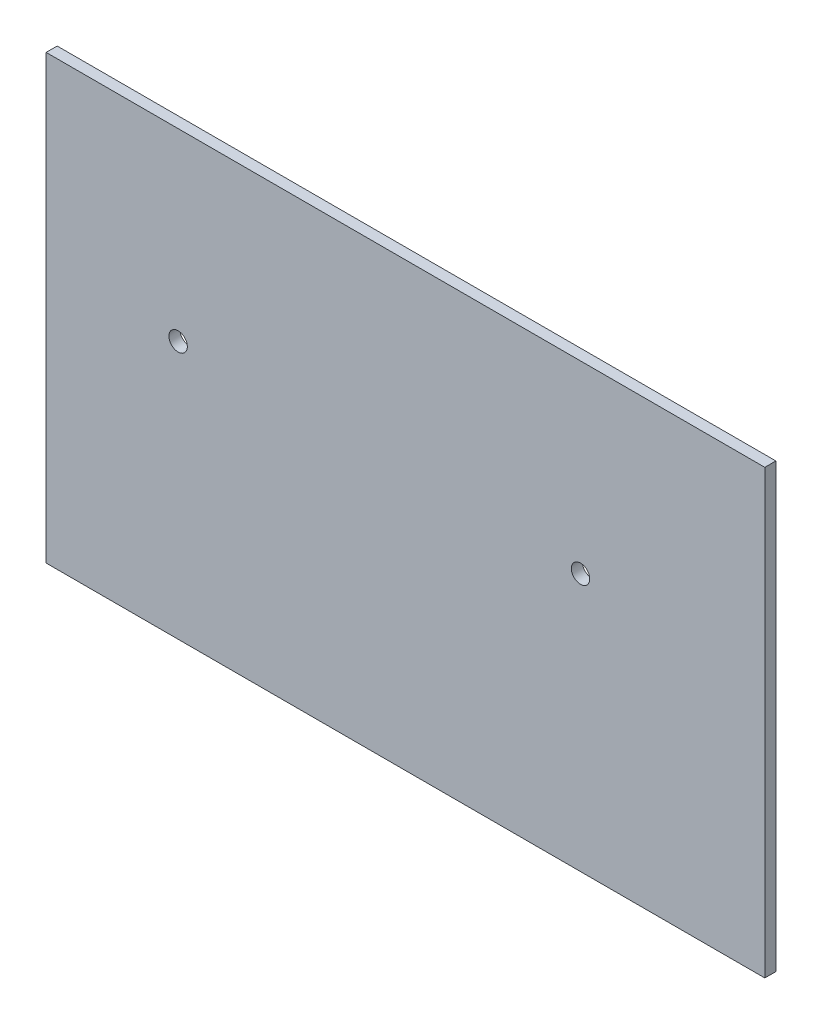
ISO-10303-21;
HEADER;
FILE_DESCRIPTION(('STEP AP214'),'2;1');
FILE_NAME('part.step','',(''),(''),'','','');
FILE_SCHEMA(('AUTOMOTIVE_DESIGN { 1 0 10303 214 1 1 1 1 }'));
ENDSEC;
DATA;
#1=APPLICATION_CONTEXT('core data for automotive mechanical design processes');
#2=APPLICATION_PROTOCOL_DEFINITION('international standard','automotive_design',2000,#1);
#3=PRODUCT_CONTEXT('',#1,'mechanical');
#4=PRODUCT('Part','Part','',(#3));
#5=PRODUCT_RELATED_PRODUCT_CATEGORY('part','',(#4));
#6=PRODUCT_DEFINITION_FORMATION('','',#4);
#7=PRODUCT_DEFINITION_CONTEXT('part definition',#1,'design');
#8=PRODUCT_DEFINITION('design','',#6,#7);
#9=PRODUCT_DEFINITION_SHAPE('','',#8);
#10=(LENGTH_UNIT() NAMED_UNIT(*) SI_UNIT(.MILLI.,.METRE.));
#11=(NAMED_UNIT(*) PLANE_ANGLE_UNIT() SI_UNIT($,.RADIAN.));
#12=(NAMED_UNIT(*) SI_UNIT($,.STERADIAN.) SOLID_ANGLE_UNIT());
#13=UNCERTAINTY_MEASURE_WITH_UNIT(LENGTH_MEASURE(1.E-05),#10,'distance_accuracy_value','');
#14=(GEOMETRIC_REPRESENTATION_CONTEXT(3) GLOBAL_UNCERTAINTY_ASSIGNED_CONTEXT((#13)) GLOBAL_UNIT_ASSIGNED_CONTEXT((#10,
#11,#12)) REPRESENTATION_CONTEXT('',''));
#15=CARTESIAN_POINT('',(0.,0.,0.));
#16=DIRECTION('',(0.,0.,1.));
#17=DIRECTION('',(1.,0.,0.));
#18=AXIS2_PLACEMENT_3D('',#15,#16,#17);
#19=CARTESIAN_POINT('',(-75.7745027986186,50.7636179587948,3.));
#20=DIRECTION('',(1.,0.,0.));
#21=DIRECTION('',(0.,1.,0.));
#22=AXIS2_PLACEMENT_3D('',#19,#20,#21);
#23=PLANE('',#22);
#24=DIRECTION('',(0.,-1.,0.));
#25=VECTOR('',#24,1.);
#26=CARTESIAN_POINT('',(-75.7745027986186,50.7636179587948,0.));
#27=LINE('',#26,#25);
#28=CARTESIAN_POINT('',(-75.7745027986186,50.7636179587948,0.));
#29=VERTEX_POINT('',#28);
#30=CARTESIAN_POINT('',(-75.7745027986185,-69.2363820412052,0.));
#31=VERTEX_POINT('',#30);
#32=EDGE_CURVE('E79',#29,#31,#27,.T.);
#33=ORIENTED_EDGE('',*,*,#32,.T.);
#34=DIRECTION('',(0.,0.,-1.));
#35=VECTOR('',#34,1.);
#36=CARTESIAN_POINT('',(-75.7745027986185,-69.2363820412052,3.));
#37=LINE('',#36,#35);
#38=CARTESIAN_POINT('',(-75.7745027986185,-69.2363820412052,3.));
#39=VERTEX_POINT('',#38);
#40=EDGE_CURVE('E11',#39,#31,#37,.T.);
#41=ORIENTED_EDGE('',*,*,#40,.F.);
#42=DIRECTION('',(0.,-1.,0.));
#43=VECTOR('',#42,1.);
#44=CARTESIAN_POINT('',(-75.7745027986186,50.7636179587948,3.));
#45=LINE('',#44,#43);
#46=CARTESIAN_POINT('',(-75.7745027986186,50.7636179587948,3.));
#47=VERTEX_POINT('',#46);
#48=EDGE_CURVE('E103',#47,#39,#45,.T.);
#49=ORIENTED_EDGE('',*,*,#48,.F.);
#50=DIRECTION('',(0.,0.,-1.));
#51=VECTOR('',#50,1.);
#52=CARTESIAN_POINT('',(-75.7745027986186,50.7636179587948,3.));
#53=LINE('',#52,#51);
#54=EDGE_CURVE('E91',#47,#29,#53,.T.);
#55=ORIENTED_EDGE('',*,*,#54,.T.);
#56=EDGE_LOOP('',(#33,#41,#49,#55));
#57=FACE_BOUND('',#56,.T.);
#58=ADVANCED_FACE('F35',(#57),#23,.F.);
#59=CARTESIAN_POINT('',(-75.7745027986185,-69.2363820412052,3.));
#60=DIRECTION('',(0.,1.,0.));
#61=DIRECTION('',(0.,0.,1.));
#62=AXIS2_PLACEMENT_3D('',#59,#60,#61);
#63=PLANE('',#62);
#64=DIRECTION('',(1.,0.,0.));
#65=VECTOR('',#64,1.);
#66=CARTESIAN_POINT('',(-75.7745027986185,-69.2363820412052,0.));
#67=LINE('',#66,#65);
#68=CARTESIAN_POINT('',(119.225497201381,-69.2363820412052,0.));
#69=VERTEX_POINT('',#68);
#70=EDGE_CURVE('E75',#31,#69,#67,.T.);
#71=ORIENTED_EDGE('',*,*,#70,.T.);
#72=DIRECTION('',(0.,0.,-1.));
#73=VECTOR('',#72,1.);
#74=CARTESIAN_POINT('',(119.225497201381,-69.2363820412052,3.));
#75=LINE('',#74,#73);
#76=CARTESIAN_POINT('',(119.225497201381,-69.2363820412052,3.));
#77=VERTEX_POINT('',#76);
#78=EDGE_CURVE('E42',#77,#69,#75,.T.);
#79=ORIENTED_EDGE('',*,*,#78,.F.);
#80=DIRECTION('',(1.,0.,0.));
#81=VECTOR('',#80,1.);
#82=CARTESIAN_POINT('',(-75.7745027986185,-69.2363820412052,3.));
#83=LINE('',#82,#81);
#84=EDGE_CURVE('E87',#39,#77,#83,.T.);
#85=ORIENTED_EDGE('',*,*,#84,.F.);
#86=ORIENTED_EDGE('',*,*,#40,.T.);
#87=EDGE_LOOP('',(#71,#79,#85,#86));
#88=FACE_BOUND('',#87,.T.);
#89=ADVANCED_FACE('F86',(#88),#63,.F.);
#90=CARTESIAN_POINT('',(119.225497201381,50.7636179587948,3.));
#91=DIRECTION('',(-1.,0.,0.));
#92=DIRECTION('',(0.,-1.,0.));
#93=AXIS2_PLACEMENT_3D('',#90,#91,#92);
#94=PLANE('',#93);
#95=DIRECTION('',(0.,1.,0.));
#96=VECTOR('',#95,1.);
#97=CARTESIAN_POINT('',(119.225497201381,50.7636179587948,0.));
#98=LINE('',#97,#96);
#99=CARTESIAN_POINT('',(119.225497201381,50.7636179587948,0.));
#100=VERTEX_POINT('',#99);
#101=EDGE_CURVE('E80',#69,#100,#98,.T.);
#102=ORIENTED_EDGE('',*,*,#101,.T.);
#103=DIRECTION('',(0.,0.,-1.));
#104=VECTOR('',#103,1.);
#105=CARTESIAN_POINT('',(119.225497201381,50.7636179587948,3.));
#106=LINE('',#105,#104);
#107=CARTESIAN_POINT('',(119.225497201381,50.7636179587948,3.));
#108=VERTEX_POINT('',#107);
#109=EDGE_CURVE('E109',#108,#100,#106,.T.);
#110=ORIENTED_EDGE('',*,*,#109,.F.);
#111=DIRECTION('',(0.,1.,0.));
#112=VECTOR('',#111,1.);
#113=CARTESIAN_POINT('',(119.225497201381,50.7636179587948,3.));
#114=LINE('',#113,#112);
#115=EDGE_CURVE('E54',#77,#108,#114,.T.);
#116=ORIENTED_EDGE('',*,*,#115,.F.);
#117=ORIENTED_EDGE('',*,*,#78,.T.);
#118=EDGE_LOOP('',(#102,#110,#116,#117));
#119=FACE_BOUND('',#118,.T.);
#120=ADVANCED_FACE('F112',(#119),#94,.F.);
#121=CARTESIAN_POINT('',(-75.7745027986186,50.7636179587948,3.));
#122=DIRECTION('',(0.,-1.,0.));
#123=DIRECTION('',(0.,0.,-1.));
#124=AXIS2_PLACEMENT_3D('',#121,#122,#123);
#125=PLANE('',#124);
#126=DIRECTION('',(-1.,0.,0.));
#127=VECTOR('',#126,1.);
#128=CARTESIAN_POINT('',(-75.7745027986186,50.7636179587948,0.));
#129=LINE('',#128,#127);
#130=EDGE_CURVE('E100',#100,#29,#129,.T.);
#131=ORIENTED_EDGE('',*,*,#130,.T.);
#132=ORIENTED_EDGE('',*,*,#54,.F.);
#133=DIRECTION('',(-1.,0.,0.));
#134=VECTOR('',#133,1.);
#135=CARTESIAN_POINT('',(-75.7745027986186,50.7636179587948,3.));
#136=LINE('',#135,#134);
#137=EDGE_CURVE('E49',#108,#47,#136,.T.);
#138=ORIENTED_EDGE('',*,*,#137,.F.);
#139=ORIENTED_EDGE('',*,*,#109,.T.);
#140=EDGE_LOOP('',(#131,#132,#138,#139));
#141=FACE_BOUND('',#140,.T.);
#142=ADVANCED_FACE('F114',(#141),#125,.F.);
#143=CARTESIAN_POINT('',(-75.7745027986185,-69.2363820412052,3.));
#144=DIRECTION('',(0.,0.,1.));
#145=DIRECTION('',(1.,0.,0.));
#146=AXIS2_PLACEMENT_3D('',#143,#144,#145);
#147=PLANE('',#146);
#148=CARTESIAN_POINT('',(-39.9648471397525,0.763617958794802,3.));
#149=DIRECTION('',(0.,0.,1.));
#150=DIRECTION('',(1.,0.,0.));
#151=AXIS2_PLACEMENT_3D('',#148,#149,#150);
#152=CIRCLE('',#151,2.5);
#153=CARTESIAN_POINT('',(-37.4648471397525,0.763617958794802,3.));
#154=VERTEX_POINT('',#153);
#155=EDGE_CURVE('E178',#154,#154,#152,.T.);
#156=ORIENTED_EDGE('',*,*,#155,.F.);
#157=EDGE_LOOP('',(#156));
#158=FACE_BOUND('',#157,.T.);
#159=CARTESIAN_POINT('',(69.2254972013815,0.763617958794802,3.));
#160=DIRECTION('',(0.,0.,1.));
#161=DIRECTION('',(1.,0.,0.));
#162=AXIS2_PLACEMENT_3D('',#159,#160,#161);
#163=CIRCLE('',#162,2.5);
#164=CARTESIAN_POINT('',(71.7254972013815,0.763617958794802,3.));
#165=VERTEX_POINT('',#164);
#166=EDGE_CURVE('E95',#165,#165,#163,.T.);
#167=ORIENTED_EDGE('',*,*,#166,.F.);
#168=EDGE_LOOP('',(#167));
#169=FACE_BOUND('',#168,.T.);
#170=ORIENTED_EDGE('',*,*,#48,.T.);
#171=ORIENTED_EDGE('',*,*,#84,.T.);
#172=ORIENTED_EDGE('',*,*,#115,.T.);
#173=ORIENTED_EDGE('',*,*,#137,.T.);
#174=EDGE_LOOP('',(#170,#171,#172,#173));
#175=FACE_BOUND('',#174,.T.);
#176=ADVANCED_FACE('F115',(#158,#169,#175),#147,.T.);
#177=CARTESIAN_POINT('',(-75.7745027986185,-69.2363820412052,0.));
#178=DIRECTION('',(0.,0.,1.));
#179=DIRECTION('',(1.,0.,0.));
#180=AXIS2_PLACEMENT_3D('',#177,#178,#179);
#181=PLANE('',#180);
#182=CARTESIAN_POINT('',(-39.9648471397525,0.763617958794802,0.));
#183=DIRECTION('',(0.,0.,1.));
#184=DIRECTION('',(1.,0.,0.));
#185=AXIS2_PLACEMENT_3D('',#182,#183,#184);
#186=CIRCLE('',#185,2.5);
#187=CARTESIAN_POINT('',(-37.4648471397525,0.763617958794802,0.));
#188=VERTEX_POINT('',#187);
#189=EDGE_CURVE('E176',#188,#188,#186,.T.);
#190=ORIENTED_EDGE('',*,*,#189,.T.);
#191=EDGE_LOOP('',(#190));
#192=FACE_BOUND('',#191,.T.);
#193=CARTESIAN_POINT('',(69.2254972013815,0.763617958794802,0.));
#194=DIRECTION('',(0.,0.,1.));
#195=DIRECTION('',(1.,0.,0.));
#196=AXIS2_PLACEMENT_3D('',#193,#194,#195);
#197=CIRCLE('',#196,2.5);
#198=CARTESIAN_POINT('',(71.7254972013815,0.763617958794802,0.));
#199=VERTEX_POINT('',#198);
#200=EDGE_CURVE('E92',#199,#199,#197,.T.);
#201=ORIENTED_EDGE('',*,*,#200,.T.);
#202=EDGE_LOOP('',(#201));
#203=FACE_BOUND('',#202,.T.);
#204=ORIENTED_EDGE('',*,*,#32,.F.);
#205=ORIENTED_EDGE('',*,*,#130,.F.);
#206=ORIENTED_EDGE('',*,*,#101,.F.);
#207=ORIENTED_EDGE('',*,*,#70,.F.);
#208=EDGE_LOOP('',(#204,#205,#206,#207));
#209=FACE_BOUND('',#208,.T.);
#210=ADVANCED_FACE('F76',(#192,#203,#209),#181,.F.);
#211=CARTESIAN_POINT('',(69.2254972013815,0.763617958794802,0.));
#212=DIRECTION('',(0.,0.,1.));
#213=DIRECTION('',(1.,0.,0.));
#214=AXIS2_PLACEMENT_3D('',#211,#212,#213);
#215=CYLINDRICAL_SURFACE('',#214,2.5);
#216=ORIENTED_EDGE('',*,*,#200,.F.);
#217=EDGE_LOOP('',(#216));
#218=FACE_BOUND('',#217,.T.);
#219=ORIENTED_EDGE('',*,*,#166,.T.);
#220=EDGE_LOOP('',(#219));
#221=FACE_BOUND('',#220,.T.);
#222=ADVANCED_FACE('F123',(#218,#221),#215,.F.);
#223=CARTESIAN_POINT('',(-39.9648471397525,0.763617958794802,0.));
#224=DIRECTION('',(0.,0.,1.));
#225=DIRECTION('',(1.,0.,0.));
#226=AXIS2_PLACEMENT_3D('',#223,#224,#225);
#227=CYLINDRICAL_SURFACE('',#226,2.5);
#228=ORIENTED_EDGE('',*,*,#189,.F.);
#229=EDGE_LOOP('',(#228));
#230=FACE_BOUND('',#229,.T.);
#231=ORIENTED_EDGE('',*,*,#155,.T.);
#232=EDGE_LOOP('',(#231));
#233=FACE_BOUND('',#232,.T.);
#234=ADVANCED_FACE('F157',(#230,#233),#227,.F.);
#235=CLOSED_SHELL('',(#58,#89,#120,#142,#176,#210,#222,#234));
#236=MANIFOLD_SOLID_BREP('B2',#235);
#237=ADVANCED_BREP_SHAPE_REPRESENTATION('',(#18,#236),#14);
#238=SHAPE_DEFINITION_REPRESENTATION(#9,#237);
ENDSEC;
END-ISO-10303-21;
